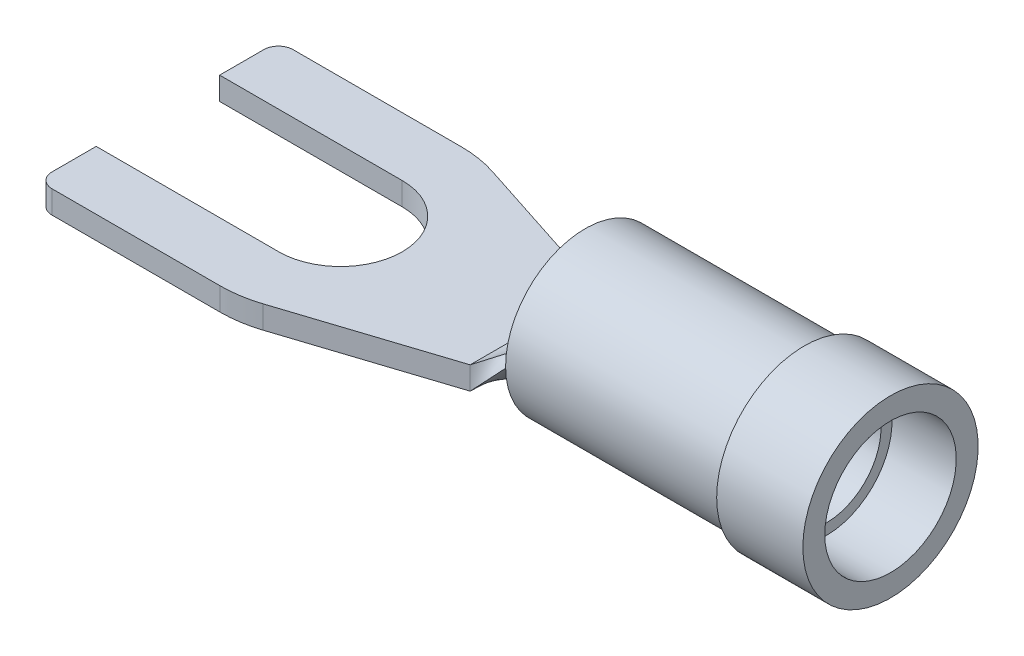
ISO-10303-21;
HEADER;
FILE_DESCRIPTION(('STEP AP214'),'2;1');
FILE_NAME('part.step','',(''),(''),'','','');
FILE_SCHEMA(('AUTOMOTIVE_DESIGN { 1 0 10303 214 1 1 1 1 }'));
ENDSEC;
DATA;
#1=APPLICATION_CONTEXT('core data for automotive mechanical design processes');
#2=APPLICATION_PROTOCOL_DEFINITION('international standard','automotive_design',2000,#1);
#3=PRODUCT_CONTEXT('',#1,'mechanical');
#4=PRODUCT('Part','Part','',(#3));
#5=PRODUCT_RELATED_PRODUCT_CATEGORY('part','',(#4));
#6=PRODUCT_DEFINITION_FORMATION('','',#4);
#7=PRODUCT_DEFINITION_CONTEXT('part definition',#1,'design');
#8=PRODUCT_DEFINITION('design','',#6,#7);
#9=PRODUCT_DEFINITION_SHAPE('','',#8);
#10=(LENGTH_UNIT() NAMED_UNIT(*) SI_UNIT(.MILLI.,.METRE.));
#11=(NAMED_UNIT(*) PLANE_ANGLE_UNIT() SI_UNIT($,.RADIAN.));
#12=(NAMED_UNIT(*) SI_UNIT($,.STERADIAN.) SOLID_ANGLE_UNIT());
#13=UNCERTAINTY_MEASURE_WITH_UNIT(LENGTH_MEASURE(1.E-05),#10,'distance_accuracy_value','');
#14=(GEOMETRIC_REPRESENTATION_CONTEXT(3) GLOBAL_UNCERTAINTY_ASSIGNED_CONTEXT((#13)) GLOBAL_UNIT_ASSIGNED_CONTEXT((#10,
#11,#12)) REPRESENTATION_CONTEXT('',''));
#15=CARTESIAN_POINT('',(0.,0.,0.));
#16=DIRECTION('',(0.,0.,1.));
#17=DIRECTION('',(1.,0.,0.));
#18=AXIS2_PLACEMENT_3D('',#15,#16,#17);
#19=CARTESIAN_POINT('',(8.509,-1.65735,0.));
#20=DIRECTION('',(-1.,0.,0.));
#21=DIRECTION('',(0.,0.,1.));
#22=AXIS2_PLACEMENT_3D('',#19,#20,#21);
#23=PLANE('',#22);
#24=CARTESIAN_POINT('',(8.509,1.11125,0.));
#25=DIRECTION('',(-1.,0.,0.));
#26=DIRECTION('',(0.,0.,1.));
#27=AXIS2_PLACEMENT_3D('',#24,#25,#26);
#28=CIRCLE('',#27,2.7686);
#29=CARTESIAN_POINT('',(8.509,1.11125,2.7686));
#30=VERTEX_POINT('',#29);
#31=EDGE_CURVE('E362',#30,#30,#28,.T.);
#32=ORIENTED_EDGE('',*,*,#31,.T.);
#33=EDGE_LOOP('',(#32));
#34=FACE_BOUND('',#33,.T.);
#35=CARTESIAN_POINT('',(8.509,1.11125,0.));
#36=DIRECTION('',(-1.,0.,0.));
#37=DIRECTION('',(0.,0.,1.));
#38=AXIS2_PLACEMENT_3D('',#35,#36,#37);
#39=CIRCLE('',#38,1.905);
#40=CARTESIAN_POINT('',(8.509,1.11125,1.905));
#41=VERTEX_POINT('',#40);
#42=EDGE_CURVE('E12',#41,#41,#39,.T.);
#43=ORIENTED_EDGE('',*,*,#42,.F.);
#44=EDGE_LOOP('',(#43));
#45=FACE_BOUND('',#44,.T.);
#46=ADVANCED_FACE('F334',(#34,#45),#23,.T.);
#47=CARTESIAN_POINT('',(5.55851083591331,1.11125,0.));
#48=DIRECTION('',(-1.,0.,0.));
#49=DIRECTION('',(0.,0.,1.));
#50=AXIS2_PLACEMENT_3D('',#47,#48,#49);
#51=CYLINDRICAL_SURFACE('',#50,1.905);
#52=ORIENTED_EDGE('',*,*,#42,.T.);
#53=EDGE_LOOP('',(#52));
#54=FACE_BOUND('',#53,.T.);
#55=CARTESIAN_POINT('',(16.891,1.11125,0.));
#56=DIRECTION('',(-1.,0.,0.));
#57=DIRECTION('',(0.,0.,1.));
#58=AXIS2_PLACEMENT_3D('',#55,#56,#57);
#59=CIRCLE('',#58,1.905);
#60=CARTESIAN_POINT('',(16.891,1.11125,1.905));
#61=VERTEX_POINT('',#60);
#62=EDGE_CURVE('E340',#61,#61,#59,.T.);
#63=ORIENTED_EDGE('',*,*,#62,.F.);
#64=EDGE_LOOP('',(#63));
#65=FACE_BOUND('',#64,.T.);
#66=ADVANCED_FACE('F380',(#54,#65),#51,.F.);
#67=CARTESIAN_POINT('',(16.891,-1.17475,0.));
#68=DIRECTION('',(1.,0.,0.));
#69=DIRECTION('',(0.,0.,-1.));
#70=AXIS2_PLACEMENT_3D('',#67,#68,#69);
#71=PLANE('',#70);
#72=ORIENTED_EDGE('',*,*,#62,.T.);
#73=EDGE_LOOP('',(#72));
#74=FACE_BOUND('',#73,.T.);
#75=CARTESIAN_POINT('',(16.891,1.11125,0.));
#76=DIRECTION('',(-1.,0.,0.));
#77=DIRECTION('',(0.,0.,1.));
#78=AXIS2_PLACEMENT_3D('',#75,#76,#77);
#79=CIRCLE('',#78,2.286);
#80=CARTESIAN_POINT('',(16.891,1.11125,2.286));
#81=VERTEX_POINT('',#80);
#82=EDGE_CURVE('E344',#81,#81,#79,.T.);
#83=ORIENTED_EDGE('',*,*,#82,.F.);
#84=EDGE_LOOP('',(#83));
#85=FACE_BOUND('',#84,.T.);
#86=ADVANCED_FACE('F384',(#74,#85),#71,.T.);
#87=CARTESIAN_POINT('',(5.55851083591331,1.11125,0.));
#88=DIRECTION('',(-1.,0.,0.));
#89=DIRECTION('',(0.,0.,1.));
#90=AXIS2_PLACEMENT_3D('',#87,#88,#89);
#91=CYLINDRICAL_SURFACE('',#90,2.286);
#92=ORIENTED_EDGE('',*,*,#82,.T.);
#93=EDGE_LOOP('',(#92));
#94=FACE_BOUND('',#93,.T.);
#95=CARTESIAN_POINT('',(19.1262,1.11125,0.));
#96=DIRECTION('',(-1.,0.,0.));
#97=DIRECTION('',(0.,0.,1.));
#98=AXIS2_PLACEMENT_3D('',#95,#96,#97);
#99=CIRCLE('',#98,2.286);
#100=CARTESIAN_POINT('',(19.1262,1.11125,2.286));
#101=VERTEX_POINT('',#100);
#102=EDGE_CURVE('E348',#101,#101,#99,.T.);
#103=ORIENTED_EDGE('',*,*,#102,.F.);
#104=EDGE_LOOP('',(#103));
#105=FACE_BOUND('',#104,.T.);
#106=ADVANCED_FACE('F388',(#94,#105),#91,.F.);
#107=CARTESIAN_POINT('',(19.1262,-1.93675,0.));
#108=DIRECTION('',(1.,0.,0.));
#109=DIRECTION('',(0.,0.,-1.));
#110=AXIS2_PLACEMENT_3D('',#107,#108,#109);
#111=PLANE('',#110);
#112=ORIENTED_EDGE('',*,*,#102,.T.);
#113=EDGE_LOOP('',(#112));
#114=FACE_BOUND('',#113,.T.);
#115=CARTESIAN_POINT('',(19.1262,1.11125,0.));
#116=DIRECTION('',(-1.,0.,0.));
#117=DIRECTION('',(0.,0.,1.));
#118=AXIS2_PLACEMENT_3D('',#115,#116,#117);
#119=CIRCLE('',#118,3.048);
#120=CARTESIAN_POINT('',(19.1262,1.11125,3.048));
#121=VERTEX_POINT('',#120);
#122=EDGE_CURVE('E353',#121,#121,#119,.T.);
#123=ORIENTED_EDGE('',*,*,#122,.F.);
#124=EDGE_LOOP('',(#123));
#125=FACE_BOUND('',#124,.T.);
#126=ADVANCED_FACE('F394',(#114,#125),#111,.T.);
#127=CARTESIAN_POINT('',(5.55851083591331,1.11125,0.));
#128=DIRECTION('',(-1.,0.,0.));
#129=DIRECTION('',(0.,0.,1.));
#130=AXIS2_PLACEMENT_3D('',#127,#128,#129);
#131=CYLINDRICAL_SURFACE('',#130,3.048);
#132=ORIENTED_EDGE('',*,*,#122,.T.);
#133=EDGE_LOOP('',(#132));
#134=FACE_BOUND('',#133,.T.);
#135=CARTESIAN_POINT('',(16.129,1.11125,0.));
#136=DIRECTION('',(-1.,0.,0.));
#137=DIRECTION('',(0.,0.,1.));
#138=AXIS2_PLACEMENT_3D('',#135,#136,#137);
#139=CIRCLE('',#138,3.048);
#140=CARTESIAN_POINT('',(16.129,1.11125,3.048));
#141=VERTEX_POINT('',#140);
#142=EDGE_CURVE('E356',#141,#141,#139,.T.);
#143=ORIENTED_EDGE('',*,*,#142,.F.);
#144=EDGE_LOOP('',(#143));
#145=FACE_BOUND('',#144,.T.);
#146=ADVANCED_FACE('F376',(#134,#145),#131,.T.);
#147=CARTESIAN_POINT('',(16.129,-1.93675,0.));
#148=DIRECTION('',(-1.,0.,0.));
#149=DIRECTION('',(0.,0.,1.));
#150=AXIS2_PLACEMENT_3D('',#147,#148,#149);
#151=PLANE('',#150);
#152=ORIENTED_EDGE('',*,*,#142,.T.);
#153=EDGE_LOOP('',(#152));
#154=FACE_BOUND('',#153,.T.);
#155=CARTESIAN_POINT('',(16.129,1.11125,0.));
#156=DIRECTION('',(-1.,0.,0.));
#157=DIRECTION('',(0.,0.,1.));
#158=AXIS2_PLACEMENT_3D('',#155,#156,#157);
#159=CIRCLE('',#158,2.7686);
#160=CARTESIAN_POINT('',(16.129,1.11125,2.7686));
#161=VERTEX_POINT('',#160);
#162=EDGE_CURVE('E359',#161,#161,#159,.T.);
#163=ORIENTED_EDGE('',*,*,#162,.F.);
#164=EDGE_LOOP('',(#163));
#165=FACE_BOUND('',#164,.T.);
#166=ADVANCED_FACE('F370',(#154,#165),#151,.T.);
#167=CARTESIAN_POINT('',(5.55851083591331,1.11125,0.));
#168=DIRECTION('',(-1.,0.,0.));
#169=DIRECTION('',(0.,0.,1.));
#170=AXIS2_PLACEMENT_3D('',#167,#168,#169);
#171=CYLINDRICAL_SURFACE('',#170,2.7686);
#172=ORIENTED_EDGE('',*,*,#162,.T.);
#173=EDGE_LOOP('',(#172));
#174=FACE_BOUND('',#173,.T.);
#175=ORIENTED_EDGE('',*,*,#31,.F.);
#176=EDGE_LOOP('',(#175));
#177=FACE_BOUND('',#176,.T.);
#178=ADVANCED_FACE('F368',(#174,#177),#171,.T.);
#179=CLOSED_SHELL('',(#46,#66,#86,#106,#126,#146,#166,#178));
#180=MANIFOLD_SOLID_BREP('B2',#179);
#181=CARTESIAN_POINT('',(-5.842,-0.79375,-3.683));
#182=DIRECTION('',(0.,1.,0.));
#183=DIRECTION('',(0.,0.,1.));
#184=AXIS2_PLACEMENT_3D('',#181,#182,#183);
#185=CYLINDRICAL_SURFACE('',#184,0.508);
#186=CARTESIAN_POINT('',(-5.842,0.,-3.683));
#187=DIRECTION('',(0.,1.,0.));
#188=DIRECTION('',(0.,0.,1.));
#189=AXIS2_PLACEMENT_3D('',#186,#187,#188);
#190=CIRCLE('',#189,0.508);
#191=CARTESIAN_POINT('',(-5.842,0.,-4.191));
#192=VERTEX_POINT('',#191);
#193=CARTESIAN_POINT('',(-6.35,0.,-3.683));
#194=VERTEX_POINT('',#193);
#195=EDGE_CURVE('E598',#192,#194,#190,.T.);
#196=ORIENTED_EDGE('',*,*,#195,.F.);
#197=DIRECTION('',(0.,1.,0.));
#198=VECTOR('',#197,1.);
#199=CARTESIAN_POINT('',(-5.842,-0.79375,-4.191));
#200=LINE('',#199,#198);
#201=CARTESIAN_POINT('',(-5.842,-0.79375,-4.191));
#202=VERTEX_POINT('',#201);
#203=EDGE_CURVE('E332',#202,#192,#200,.T.);
#204=ORIENTED_EDGE('',*,*,#203,.F.);
#205=CARTESIAN_POINT('',(-5.842,-0.79375,-3.683));
#206=DIRECTION('',(0.,1.,0.));
#207=DIRECTION('',(0.,0.,1.));
#208=AXIS2_PLACEMENT_3D('',#205,#206,#207);
#209=CIRCLE('',#208,0.508);
#210=CARTESIAN_POINT('',(-6.35,-0.79375,-3.683));
#211=VERTEX_POINT('',#210);
#212=EDGE_CURVE('E637',#202,#211,#209,.T.);
#213=ORIENTED_EDGE('',*,*,#212,.T.);
#214=DIRECTION('',(0.,1.,0.));
#215=VECTOR('',#214,1.);
#216=CARTESIAN_POINT('',(-6.35,-0.79375,-3.683));
#217=LINE('',#216,#215);
#218=EDGE_CURVE('E532',#211,#194,#217,.T.);
#219=ORIENTED_EDGE('',*,*,#218,.T.);
#220=EDGE_LOOP('',(#196,#204,#213,#219));
#221=FACE_BOUND('',#220,.T.);
#222=ADVANCED_FACE('F455',(#221),#185,.T.);
#223=CARTESIAN_POINT('',(0.,-0.79375,-4.191));
#224=DIRECTION('',(0.,0.,-1.));
#225=DIRECTION('',(-1.,0.,0.));
#226=AXIS2_PLACEMENT_3D('',#223,#224,#225);
#227=PLANE('',#226);
#228=DIRECTION('',(-1.,0.,0.));
#229=VECTOR('',#228,1.);
#230=CARTESIAN_POINT('',(0.,0.,-4.191));
#231=LINE('',#230,#229);
#232=CARTESIAN_POINT('',(0.,0.,-4.191));
#233=VERTEX_POINT('',#232);
#234=EDGE_CURVE('E635',#233,#192,#231,.T.);
#235=ORIENTED_EDGE('',*,*,#234,.F.);
#236=DIRECTION('',(0.,1.,0.));
#237=VECTOR('',#236,1.);
#238=CARTESIAN_POINT('',(0.,-0.79375,-4.191));
#239=LINE('',#238,#237);
#240=CARTESIAN_POINT('',(0.,-0.79375,-4.191));
#241=VERTEX_POINT('',#240);
#242=EDGE_CURVE('E463',#241,#233,#239,.T.);
#243=ORIENTED_EDGE('',*,*,#242,.F.);
#244=DIRECTION('',(-1.,0.,0.));
#245=VECTOR('',#244,1.);
#246=CARTESIAN_POINT('',(0.,-0.79375,-4.191));
#247=LINE('',#246,#245);
#248=EDGE_CURVE('E584',#241,#202,#247,.T.);
#249=ORIENTED_EDGE('',*,*,#248,.T.);
#250=ORIENTED_EDGE('',*,*,#203,.T.);
#251=EDGE_LOOP('',(#235,#243,#249,#250));
#252=FACE_BOUND('',#251,.T.);
#253=ADVANCED_FACE('F817',(#252),#227,.T.);
#254=CARTESIAN_POINT('',(0.,-0.79375,0.));
#255=DIRECTION('',(0.,1.,0.));
#256=DIRECTION('',(0.,0.,1.));
#257=AXIS2_PLACEMENT_3D('',#254,#255,#256);
#258=CYLINDRICAL_SURFACE('',#257,4.191);
#259=CARTESIAN_POINT('',(0.,0.,0.));
#260=DIRECTION('',(0.,1.,0.));
#261=DIRECTION('',(0.,0.,1.));
#262=AXIS2_PLACEMENT_3D('',#259,#260,#261);
#263=CIRCLE('',#262,4.191);
#264=CARTESIAN_POINT('',(1.29319573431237,0.,-3.98649291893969));
#265=VERTEX_POINT('',#264);
#266=EDGE_CURVE('E575',#265,#233,#263,.T.);
#267=ORIENTED_EDGE('',*,*,#266,.F.);
#268=DIRECTION('',(0.,1.,0.));
#269=VECTOR('',#268,1.);
#270=CARTESIAN_POINT('',(1.29319573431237,-0.79375,-3.98649291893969));
#271=LINE('',#270,#269);
#272=CARTESIAN_POINT('',(1.29319573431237,-0.79375,-3.98649291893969));
#273=VERTEX_POINT('',#272);
#274=EDGE_CURVE('E569',#273,#265,#271,.T.);
#275=ORIENTED_EDGE('',*,*,#274,.F.);
#276=CARTESIAN_POINT('',(0.,-0.79375,0.));
#277=DIRECTION('',(0.,1.,0.));
#278=DIRECTION('',(0.,0.,1.));
#279=AXIS2_PLACEMENT_3D('',#276,#277,#278);
#280=CIRCLE('',#279,4.191);
#281=EDGE_CURVE('E572',#273,#241,#280,.T.);
#282=ORIENTED_EDGE('',*,*,#281,.T.);
#283=ORIENTED_EDGE('',*,*,#242,.T.);
#284=EDGE_LOOP('',(#267,#275,#282,#283));
#285=FACE_BOUND('',#284,.T.);
#286=ADVANCED_FACE('F571',(#285),#258,.T.);
#287=CARTESIAN_POINT('',(6.731,-0.79375,-2.2225));
#288=DIRECTION('',(0.308564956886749,0.,-0.951203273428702));
#289=DIRECTION('',(-0.951203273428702,0.,-0.308564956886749));
#290=AXIS2_PLACEMENT_3D('',#287,#288,#289);
#291=PLANE('',#290);
#292=DIRECTION('',(-0.951203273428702,0.,-0.308564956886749));
#293=VECTOR('',#292,1.);
#294=CARTESIAN_POINT('',(6.731,0.,-2.2225));
#295=LINE('',#294,#293);
#296=CARTESIAN_POINT('',(6.731,0.,-2.2225));
#297=VERTEX_POINT('',#296);
#298=EDGE_CURVE('E632',#297,#265,#295,.T.);
#299=ORIENTED_EDGE('',*,*,#298,.F.);
#300=DIRECTION('',(0.,1.,0.));
#301=VECTOR('',#300,1.);
#302=CARTESIAN_POINT('',(6.731,-0.79375,-2.2225));
#303=LINE('',#302,#301);
#304=CARTESIAN_POINT('',(6.731,-0.79375,-2.2225));
#305=VERTEX_POINT('',#304);
#306=EDGE_CURVE('E580',#305,#297,#303,.T.);
#307=ORIENTED_EDGE('',*,*,#306,.F.);
#308=DIRECTION('',(-0.951203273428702,0.,-0.308564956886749));
#309=VECTOR('',#308,1.);
#310=CARTESIAN_POINT('',(6.731,-0.79375,-2.2225));
#311=LINE('',#310,#309);
#312=EDGE_CURVE('E583',#305,#273,#311,.T.);
#313=ORIENTED_EDGE('',*,*,#312,.T.);
#314=ORIENTED_EDGE('',*,*,#274,.T.);
#315=EDGE_LOOP('',(#299,#307,#313,#314));
#316=FACE_BOUND('',#315,.T.);
#317=ADVANCED_FACE('F586',(#316),#291,.T.);
#318=CARTESIAN_POINT('',(6.731,-0.79375,2.2225));
#319=DIRECTION('',(0.308564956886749,0.,0.951203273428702));
#320=DIRECTION('',(0.951203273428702,0.,-0.308564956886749));
#321=AXIS2_PLACEMENT_3D('',#318,#319,#320);
#322=PLANE('',#321);
#323=DIRECTION('',(0.951203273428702,0.,-0.308564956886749));
#324=VECTOR('',#323,1.);
#325=CARTESIAN_POINT('',(6.731,0.,2.2225));
#326=LINE('',#325,#324);
#327=CARTESIAN_POINT('',(1.29319573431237,0.,3.98649291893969));
#328=VERTEX_POINT('',#327);
#329=CARTESIAN_POINT('',(6.731,0.,2.2225));
#330=VERTEX_POINT('',#329);
#331=EDGE_CURVE('E626',#328,#330,#326,.T.);
#332=ORIENTED_EDGE('',*,*,#331,.F.);
#333=DIRECTION('',(0.,1.,0.));
#334=VECTOR('',#333,1.);
#335=CARTESIAN_POINT('',(1.29319573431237,-0.79375,3.98649291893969));
#336=LINE('',#335,#334);
#337=CARTESIAN_POINT('',(1.29319573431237,-0.79375,3.98649291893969));
#338=VERTEX_POINT('',#337);
#339=EDGE_CURVE('E643',#338,#328,#336,.T.);
#340=ORIENTED_EDGE('',*,*,#339,.F.);
#341=DIRECTION('',(0.951203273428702,0.,-0.308564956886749));
#342=VECTOR('',#341,1.);
#343=CARTESIAN_POINT('',(6.731,-0.79375,2.2225));
#344=LINE('',#343,#342);
#345=CARTESIAN_POINT('',(6.731,-0.79375,2.2225));
#346=VERTEX_POINT('',#345);
#347=EDGE_CURVE('E591',#338,#346,#344,.T.);
#348=ORIENTED_EDGE('',*,*,#347,.T.);
#349=DIRECTION('',(0.,1.,0.));
#350=VECTOR('',#349,1.);
#351=CARTESIAN_POINT('',(6.731,-0.79375,2.2225));
#352=LINE('',#351,#350);
#353=EDGE_CURVE('E641',#346,#330,#352,.T.);
#354=ORIENTED_EDGE('',*,*,#353,.T.);
#355=EDGE_LOOP('',(#332,#340,#348,#354));
#356=FACE_BOUND('',#355,.T.);
#357=ADVANCED_FACE('F699',(#356),#322,.T.);
#358=CARTESIAN_POINT('',(0.,-0.79375,0.));
#359=DIRECTION('',(0.,1.,0.));
#360=DIRECTION('',(0.,0.,1.));
#361=AXIS2_PLACEMENT_3D('',#358,#359,#360);
#362=CYLINDRICAL_SURFACE('',#361,4.191);
#363=CARTESIAN_POINT('',(0.,0.,0.));
#364=DIRECTION('',(0.,1.,0.));
#365=DIRECTION('',(0.,0.,1.));
#366=AXIS2_PLACEMENT_3D('',#363,#364,#365);
#367=CIRCLE('',#366,4.191);
#368=CARTESIAN_POINT('',(0.,0.,4.191));
#369=VERTEX_POINT('',#368);
#370=EDGE_CURVE('E623',#369,#328,#367,.T.);
#371=ORIENTED_EDGE('',*,*,#370,.F.);
#372=DIRECTION('',(0.,1.,0.));
#373=VECTOR('',#372,1.);
#374=CARTESIAN_POINT('',(0.,-0.79375,4.191));
#375=LINE('',#374,#373);
#376=CARTESIAN_POINT('',(0.,-0.79375,4.191));
#377=VERTEX_POINT('',#376);
#378=EDGE_CURVE('E645',#377,#369,#375,.T.);
#379=ORIENTED_EDGE('',*,*,#378,.F.);
#380=CARTESIAN_POINT('',(0.,-0.79375,0.));
#381=DIRECTION('',(0.,1.,0.));
#382=DIRECTION('',(0.,0.,1.));
#383=AXIS2_PLACEMENT_3D('',#380,#381,#382);
#384=CIRCLE('',#383,4.191);
#385=EDGE_CURVE('E692',#377,#338,#384,.T.);
#386=ORIENTED_EDGE('',*,*,#385,.T.);
#387=ORIENTED_EDGE('',*,*,#339,.T.);
#388=EDGE_LOOP('',(#371,#379,#386,#387));
#389=FACE_BOUND('',#388,.T.);
#390=ADVANCED_FACE('F849',(#389),#362,.T.);
#391=CARTESIAN_POINT('',(0.,-0.79375,4.191));
#392=DIRECTION('',(0.,0.,1.));
#393=DIRECTION('',(1.,0.,0.));
#394=AXIS2_PLACEMENT_3D('',#391,#392,#393);
#395=PLANE('',#394);
#396=DIRECTION('',(1.,0.,0.));
#397=VECTOR('',#396,1.);
#398=CARTESIAN_POINT('',(0.,0.,4.191));
#399=LINE('',#398,#397);
#400=CARTESIAN_POINT('',(-5.842,0.,4.191));
#401=VERTEX_POINT('',#400);
#402=EDGE_CURVE('E620',#401,#369,#399,.T.);
#403=ORIENTED_EDGE('',*,*,#402,.F.);
#404=DIRECTION('',(0.,1.,0.));
#405=VECTOR('',#404,1.);
#406=CARTESIAN_POINT('',(-5.842,-0.79375,4.191));
#407=LINE('',#406,#405);
#408=CARTESIAN_POINT('',(-5.842,-0.79375,4.191));
#409=VERTEX_POINT('',#408);
#410=EDGE_CURVE('E647',#409,#401,#407,.T.);
#411=ORIENTED_EDGE('',*,*,#410,.F.);
#412=DIRECTION('',(1.,0.,0.));
#413=VECTOR('',#412,1.);
#414=CARTESIAN_POINT('',(0.,-0.79375,4.191));
#415=LINE('',#414,#413);
#416=EDGE_CURVE('E689',#409,#377,#415,.T.);
#417=ORIENTED_EDGE('',*,*,#416,.T.);
#418=ORIENTED_EDGE('',*,*,#378,.T.);
#419=EDGE_LOOP('',(#403,#411,#417,#418));
#420=FACE_BOUND('',#419,.T.);
#421=ADVANCED_FACE('F846',(#420),#395,.T.);
#422=CARTESIAN_POINT('',(-5.842,-0.79375,3.683));
#423=DIRECTION('',(0.,1.,0.));
#424=DIRECTION('',(0.,0.,1.));
#425=AXIS2_PLACEMENT_3D('',#422,#423,#424);
#426=CYLINDRICAL_SURFACE('',#425,0.508);
#427=CARTESIAN_POINT('',(-5.842,0.,3.683));
#428=DIRECTION('',(0.,1.,0.));
#429=DIRECTION('',(0.,0.,-1.));
#430=AXIS2_PLACEMENT_3D('',#427,#428,#429);
#431=CIRCLE('',#430,0.508);
#432=CARTESIAN_POINT('',(-6.35,0.,3.683));
#433=VERTEX_POINT('',#432);
#434=EDGE_CURVE('E617',#433,#401,#431,.T.);
#435=ORIENTED_EDGE('',*,*,#434,.F.);
#436=DIRECTION('',(0.,1.,0.));
#437=VECTOR('',#436,1.);
#438=CARTESIAN_POINT('',(-6.35,-0.79375,3.683));
#439=LINE('',#438,#437);
#440=CARTESIAN_POINT('',(-6.35,-0.79375,3.683));
#441=VERTEX_POINT('',#440);
#442=EDGE_CURVE('E649',#441,#433,#439,.T.);
#443=ORIENTED_EDGE('',*,*,#442,.F.);
#444=CARTESIAN_POINT('',(-5.842,-0.79375,3.683));
#445=DIRECTION('',(0.,1.,0.));
#446=DIRECTION('',(0.,0.,-1.));
#447=AXIS2_PLACEMENT_3D('',#444,#445,#446);
#448=CIRCLE('',#447,0.508);
#449=EDGE_CURVE('E686',#441,#409,#448,.T.);
#450=ORIENTED_EDGE('',*,*,#449,.T.);
#451=ORIENTED_EDGE('',*,*,#410,.T.);
#452=EDGE_LOOP('',(#435,#443,#450,#451));
#453=FACE_BOUND('',#452,.T.);
#454=ADVANCED_FACE('F842',(#453),#426,.T.);
#455=CARTESIAN_POINT('',(-6.35,-0.79375,2.1463));
#456=DIRECTION('',(-1.,0.,0.));
#457=DIRECTION('',(0.,0.,1.));
#458=AXIS2_PLACEMENT_3D('',#455,#456,#457);
#459=PLANE('',#458);
#460=DIRECTION('',(0.,0.,1.));
#461=VECTOR('',#460,1.);
#462=CARTESIAN_POINT('',(-6.35,0.,2.1463));
#463=LINE('',#462,#461);
#464=CARTESIAN_POINT('',(-6.35,0.,2.1463));
#465=VERTEX_POINT('',#464);
#466=EDGE_CURVE('E614',#465,#433,#463,.T.);
#467=ORIENTED_EDGE('',*,*,#466,.F.);
#468=DIRECTION('',(0.,1.,0.));
#469=VECTOR('',#468,1.);
#470=CARTESIAN_POINT('',(-6.35,-0.79375,2.1463));
#471=LINE('',#470,#469);
#472=CARTESIAN_POINT('',(-6.35,-0.79375,2.1463));
#473=VERTEX_POINT('',#472);
#474=EDGE_CURVE('E651',#473,#465,#471,.T.);
#475=ORIENTED_EDGE('',*,*,#474,.F.);
#476=DIRECTION('',(0.,0.,1.));
#477=VECTOR('',#476,1.);
#478=CARTESIAN_POINT('',(-6.35,-0.79375,2.1463));
#479=LINE('',#478,#477);
#480=EDGE_CURVE('E683',#473,#441,#479,.T.);
#481=ORIENTED_EDGE('',*,*,#480,.T.);
#482=ORIENTED_EDGE('',*,*,#442,.T.);
#483=EDGE_LOOP('',(#467,#475,#481,#482));
#484=FACE_BOUND('',#483,.T.);
#485=ADVANCED_FACE('F838',(#484),#459,.T.);
#486=CARTESIAN_POINT('',(0.,-0.79375,2.1463));
#487=DIRECTION('',(0.,0.,-1.));
#488=DIRECTION('',(-1.,0.,0.));
#489=AXIS2_PLACEMENT_3D('',#486,#487,#488);
#490=PLANE('',#489);
#491=DIRECTION('',(-1.,0.,0.));
#492=VECTOR('',#491,1.);
#493=CARTESIAN_POINT('',(0.,0.,2.1463));
#494=LINE('',#493,#492);
#495=CARTESIAN_POINT('',(0.,0.,2.1463));
#496=VERTEX_POINT('',#495);
#497=EDGE_CURVE('E611',#496,#465,#494,.T.);
#498=ORIENTED_EDGE('',*,*,#497,.F.);
#499=DIRECTION('',(0.,1.,0.));
#500=VECTOR('',#499,1.);
#501=CARTESIAN_POINT('',(0.,-0.79375,2.1463));
#502=LINE('',#501,#500);
#503=CARTESIAN_POINT('',(0.,-0.79375,2.1463));
#504=VERTEX_POINT('',#503);
#505=EDGE_CURVE('E653',#504,#496,#502,.T.);
#506=ORIENTED_EDGE('',*,*,#505,.F.);
#507=DIRECTION('',(-1.,0.,0.));
#508=VECTOR('',#507,1.);
#509=CARTESIAN_POINT('',(0.,-0.79375,2.1463));
#510=LINE('',#509,#508);
#511=EDGE_CURVE('E680',#504,#473,#510,.T.);
#512=ORIENTED_EDGE('',*,*,#511,.T.);
#513=ORIENTED_EDGE('',*,*,#474,.T.);
#514=EDGE_LOOP('',(#498,#506,#512,#513));
#515=FACE_BOUND('',#514,.T.);
#516=ADVANCED_FACE('F834',(#515),#490,.T.);
#517=CARTESIAN_POINT('',(0.,-0.79375,0.));
#518=DIRECTION('',(0.,1.,0.));
#519=DIRECTION('',(0.,0.,1.));
#520=AXIS2_PLACEMENT_3D('',#517,#518,#519);
#521=CYLINDRICAL_SURFACE('',#520,2.1463);
#522=CARTESIAN_POINT('',(0.,0.,0.));
#523=DIRECTION('',(0.,-1.,0.));
#524=DIRECTION('',(0.,0.,1.));
#525=AXIS2_PLACEMENT_3D('',#522,#523,#524);
#526=CIRCLE('',#525,2.1463);
#527=CARTESIAN_POINT('',(0.,0.,-2.1463));
#528=VERTEX_POINT('',#527);
#529=EDGE_CURVE('E608',#528,#496,#526,.T.);
#530=ORIENTED_EDGE('',*,*,#529,.F.);
#531=DIRECTION('',(0.,1.,0.));
#532=VECTOR('',#531,1.);
#533=CARTESIAN_POINT('',(0.,-0.79375,-2.1463));
#534=LINE('',#533,#532);
#535=CARTESIAN_POINT('',(0.,-0.79375,-2.1463));
#536=VERTEX_POINT('',#535);
#537=EDGE_CURVE('E655',#536,#528,#534,.T.);
#538=ORIENTED_EDGE('',*,*,#537,.F.);
#539=CARTESIAN_POINT('',(0.,-0.79375,0.));
#540=DIRECTION('',(0.,-1.,0.));
#541=DIRECTION('',(0.,0.,1.));
#542=AXIS2_PLACEMENT_3D('',#539,#540,#541);
#543=CIRCLE('',#542,2.1463);
#544=EDGE_CURVE('E677',#536,#504,#543,.T.);
#545=ORIENTED_EDGE('',*,*,#544,.T.);
#546=ORIENTED_EDGE('',*,*,#505,.T.);
#547=EDGE_LOOP('',(#530,#538,#545,#546));
#548=FACE_BOUND('',#547,.T.);
#549=ADVANCED_FACE('F830',(#548),#521,.F.);
#550=CARTESIAN_POINT('',(0.,-0.79375,-2.1463));
#551=DIRECTION('',(0.,0.,1.));
#552=DIRECTION('',(1.,0.,0.));
#553=AXIS2_PLACEMENT_3D('',#550,#551,#552);
#554=PLANE('',#553);
#555=DIRECTION('',(1.,0.,0.));
#556=VECTOR('',#555,1.);
#557=CARTESIAN_POINT('',(0.,0.,-2.1463));
#558=LINE('',#557,#556);
#559=CARTESIAN_POINT('',(-6.35,0.,-2.1463));
#560=VERTEX_POINT('',#559);
#561=EDGE_CURVE('E605',#560,#528,#558,.T.);
#562=ORIENTED_EDGE('',*,*,#561,.F.);
#563=DIRECTION('',(0.,1.,0.));
#564=VECTOR('',#563,1.);
#565=CARTESIAN_POINT('',(-6.35,-0.79375,-2.1463));
#566=LINE('',#565,#564);
#567=CARTESIAN_POINT('',(-6.35,-0.79375,-2.1463));
#568=VERTEX_POINT('',#567);
#569=EDGE_CURVE('E657',#568,#560,#566,.T.);
#570=ORIENTED_EDGE('',*,*,#569,.F.);
#571=DIRECTION('',(1.,0.,0.));
#572=VECTOR('',#571,1.);
#573=CARTESIAN_POINT('',(0.,-0.79375,-2.1463));
#574=LINE('',#573,#572);
#575=EDGE_CURVE('E674',#568,#536,#574,.T.);
#576=ORIENTED_EDGE('',*,*,#575,.T.);
#577=ORIENTED_EDGE('',*,*,#537,.T.);
#578=EDGE_LOOP('',(#562,#570,#576,#577));
#579=FACE_BOUND('',#578,.T.);
#580=ADVANCED_FACE('F826',(#579),#554,.T.);
#581=CARTESIAN_POINT('',(-6.35,-0.79375,-3.683));
#582=DIRECTION('',(-1.,0.,0.));
#583=DIRECTION('',(0.,0.,1.));
#584=AXIS2_PLACEMENT_3D('',#581,#582,#583);
#585=PLANE('',#584);
#586=DIRECTION('',(0.,0.,1.));
#587=VECTOR('',#586,1.);
#588=CARTESIAN_POINT('',(-6.35,0.,-3.683));
#589=LINE('',#588,#587);
#590=EDGE_CURVE('E601',#194,#560,#589,.T.);
#591=ORIENTED_EDGE('',*,*,#590,.F.);
#592=ORIENTED_EDGE('',*,*,#218,.F.);
#593=DIRECTION('',(0.,0.,1.));
#594=VECTOR('',#593,1.);
#595=CARTESIAN_POINT('',(-6.35,-0.79375,-3.683));
#596=LINE('',#595,#594);
#597=EDGE_CURVE('E672',#211,#568,#596,.T.);
#598=ORIENTED_EDGE('',*,*,#597,.T.);
#599=ORIENTED_EDGE('',*,*,#569,.T.);
#600=EDGE_LOOP('',(#591,#592,#598,#599));
#601=FACE_BOUND('',#600,.T.);
#602=ADVANCED_FACE('F823',(#601),#585,.T.);
#603=CARTESIAN_POINT('',(-5.842,-0.79375,-3.683));
#604=DIRECTION('',(0.,1.,0.));
#605=DIRECTION('',(0.,0.,1.));
#606=AXIS2_PLACEMENT_3D('',#603,#604,#605);
#607=PLANE('',#606);
#608=ORIENTED_EDGE('',*,*,#212,.F.);
#609=ORIENTED_EDGE('',*,*,#248,.F.);
#610=ORIENTED_EDGE('',*,*,#281,.F.);
#611=ORIENTED_EDGE('',*,*,#312,.F.);
#612=DIRECTION('',(0.,0.,-1.));
#613=VECTOR('',#612,1.);
#614=CARTESIAN_POINT('',(6.731,-0.79375,2.2225));
#615=LINE('',#614,#613);
#616=CARTESIAN_POINT('',(6.731,-0.79375,0.));
#617=VERTEX_POINT('',#616);
#618=EDGE_CURVE('E471',#617,#305,#615,.T.);
#619=ORIENTED_EDGE('',*,*,#618,.F.);
#620=DIRECTION('',(0.,0.,-1.));
#621=VECTOR('',#620,1.);
#622=CARTESIAN_POINT('',(6.731,-0.79375,-2.2225));
#623=LINE('',#622,#621);
#624=EDGE_CURVE('E588',#346,#617,#623,.T.);
#625=ORIENTED_EDGE('',*,*,#624,.F.);
#626=ORIENTED_EDGE('',*,*,#347,.F.);
#627=ORIENTED_EDGE('',*,*,#385,.F.);
#628=ORIENTED_EDGE('',*,*,#416,.F.);
#629=ORIENTED_EDGE('',*,*,#449,.F.);
#630=ORIENTED_EDGE('',*,*,#480,.F.);
#631=ORIENTED_EDGE('',*,*,#511,.F.);
#632=ORIENTED_EDGE('',*,*,#544,.F.);
#633=ORIENTED_EDGE('',*,*,#575,.F.);
#634=ORIENTED_EDGE('',*,*,#597,.F.);
#635=EDGE_LOOP('',(#608,#609,#610,#611,#619,#625,#626,#627,#628,#629,#630,#631,#632,#633,#634));
#636=FACE_BOUND('',#635,.T.);
#637=ADVANCED_FACE('F582',(#636),#607,.F.);
#638=CARTESIAN_POINT('',(-5.842,0.,-3.683));
#639=DIRECTION('',(0.,1.,0.));
#640=DIRECTION('',(0.,0.,1.));
#641=AXIS2_PLACEMENT_3D('',#638,#639,#640);
#642=PLANE('',#641);
#643=ORIENTED_EDGE('',*,*,#195,.T.);
#644=ORIENTED_EDGE('',*,*,#590,.T.);
#645=ORIENTED_EDGE('',*,*,#561,.T.);
#646=ORIENTED_EDGE('',*,*,#529,.T.);
#647=ORIENTED_EDGE('',*,*,#497,.T.);
#648=ORIENTED_EDGE('',*,*,#466,.T.);
#649=ORIENTED_EDGE('',*,*,#434,.T.);
#650=ORIENTED_EDGE('',*,*,#402,.T.);
#651=ORIENTED_EDGE('',*,*,#370,.T.);
#652=ORIENTED_EDGE('',*,*,#331,.T.);
#653=DIRECTION('',(0.,0.,-1.));
#654=VECTOR('',#653,1.);
#655=CARTESIAN_POINT('',(6.731,0.,-2.2225));
#656=LINE('',#655,#654);
#657=EDGE_CURVE('E629',#330,#297,#656,.T.);
#658=ORIENTED_EDGE('',*,*,#657,.T.);
#659=ORIENTED_EDGE('',*,*,#298,.T.);
#660=ORIENTED_EDGE('',*,*,#266,.T.);
#661=ORIENTED_EDGE('',*,*,#234,.T.);
#662=EDGE_LOOP('',(#643,#644,#645,#646,#647,#648,#649,#650,#651,#652,#658,#659,#660,#661));
#663=FACE_BOUND('',#662,.T.);
#664=ADVANCED_FACE('F760',(#663),#642,.T.);
#665=CARTESIAN_POINT('',(8.509,1.11125,1.905));
#666=CARTESIAN_POINT('',(6.731,-0.79375,2.2225));
#667=CARTESIAN_POINT('',(8.509,1.11125,1.11125));
#668=CARTESIAN_POINT('',(6.731,0.,2.2225));
#669=B_SPLINE_SURFACE_WITH_KNOTS('',1,1,((#665,#666),(#667,#668)),.UNSPECIFIED.,.F.,.F.,.F.,(2,
2),(2,2),(0.,1.),(0.,1.),.UNSPECIFIED.);
#670=DIRECTION('',(0.,0.,-1.));
#671=VECTOR('',#670,1.);
#672=CARTESIAN_POINT('',(8.509,1.11125,1.11125));
#673=LINE('',#672,#671);
#674=CARTESIAN_POINT('',(8.509,1.11125,1.905));
#675=VERTEX_POINT('',#674);
#676=CARTESIAN_POINT('',(8.509,1.11125,1.11125));
#677=VERTEX_POINT('',#676);
#678=EDGE_CURVE('E726',#675,#677,#673,.T.);
#679=DIRECTION('',(-0.749268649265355,-0.468292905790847,0.468292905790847));
#680=VECTOR('',#679,1.);
#681=CARTESIAN_POINT('',(7.62,0.555625,1.666875));
#682=LINE('',#681,#680);
#683=EDGE_CURVE('E710',#677,#330,#682,.T.);
#684=DIRECTION('',(0.677309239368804,0.72568847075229,-0.120948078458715));
#685=VECTOR('',#684,1.);
#686=CARTESIAN_POINT('',(7.62,0.15875,2.06375));
#687=LINE('',#686,#685);
#688=EDGE_CURVE('E708',#346,#675,#687,.T.);
#689=ORIENTED_EDGE('',*,*,#678,.T.);
#690=ORIENTED_EDGE('',*,*,#683,.T.);
#691=ORIENTED_EDGE('',*,*,#353,.F.);
#692=ORIENTED_EDGE('',*,*,#688,.T.);
#693=EDGE_LOOP('',(#689,#690,#691,#692));
#694=FACE_BOUND('',#693,.T.);
#695=ADVANCED_FACE('F706',(#694),#669,.T.);
#696=CARTESIAN_POINT('',(8.509,1.11125,1.11125));
#697=CARTESIAN_POINT('',(6.731,0.,2.2225));
#698=CARTESIAN_POINT('',(8.509,-1.11125,1.11125));
#699=CARTESIAN_POINT('',(6.731,0.,0.740833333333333));
#700=CARTESIAN_POINT('',(8.509,-1.11125,-1.11125));
#701=CARTESIAN_POINT('',(6.731,0.,-0.740833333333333));
#702=CARTESIAN_POINT('',(8.509,1.11125,-1.11125));
#703=CARTESIAN_POINT('',(6.731,0.,-2.2225));
#704=(BOUNDED_SURFACE() B_SPLINE_SURFACE(3,1,((#696,#697),(#698,#699),(#700,#701),(#702,#703)),
.UNSPECIFIED.,.F.,.F.,.F.) B_SPLINE_SURFACE_WITH_KNOTS((4,4),(2,2),(0.,1.),(0.,1.),
.UNSPECIFIED.) GEOMETRIC_REPRESENTATION_ITEM() RATIONAL_B_SPLINE_SURFACE(((1.,1.),
(0.333333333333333,1.),(0.333333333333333,1.),(1.,1.))) REPRESENTATION_ITEM('') SURFACE());
#705=CARTESIAN_POINT('',(8.509,1.11125,0.));
#706=DIRECTION('',(1.,0.,0.));
#707=DIRECTION('',(0.,0.,1.));
#708=AXIS2_PLACEMENT_3D('',#705,#706,#707);
#709=CIRCLE('',#708,1.11125);
#710=CARTESIAN_POINT('',(8.509,1.11125,-1.11125));
#711=VERTEX_POINT('',#710);
#712=EDGE_CURVE('E718',#677,#711,#709,.T.);
#713=DIRECTION('',(-0.749268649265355,-0.468292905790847,-0.468292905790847));
#714=VECTOR('',#713,1.);
#715=CARTESIAN_POINT('',(7.62,0.555625,-1.666875));
#716=LINE('',#715,#714);
#717=EDGE_CURVE('E717',#711,#297,#716,.T.);
#718=ORIENTED_EDGE('',*,*,#712,.T.);
#719=ORIENTED_EDGE('',*,*,#717,.T.);
#720=ORIENTED_EDGE('',*,*,#657,.F.);
#721=ORIENTED_EDGE('',*,*,#683,.F.);
#722=EDGE_LOOP('',(#718,#719,#720,#721));
#723=FACE_BOUND('',#722,.T.);
#724=ADVANCED_FACE('F756',(#723),#704,.T.);
#725=CARTESIAN_POINT('',(8.509,-0.79375,0.));
#726=CARTESIAN_POINT('',(8.41022222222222,-0.79375,0.));
#727=CARTESIAN_POINT('',(8.21266666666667,-0.79375,0.));
#728=CARTESIAN_POINT('',(7.81755555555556,-0.79375,0.));
#729=CARTESIAN_POINT('',(7.42244444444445,-0.79375,0.));
#730=CARTESIAN_POINT('',(7.02733333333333,-0.79375,0.));
#731=CARTESIAN_POINT('',(6.82977777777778,-0.79375,0.));
#732=CARTESIAN_POINT('',(6.731,-0.79375,0.));
#733=CARTESIAN_POINT('',(8.509,-0.79375,1.11592316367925));
#734=CARTESIAN_POINT('',(8.40991296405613,-0.79375,1.09070453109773));
#735=CARTESIAN_POINT('',(8.21878079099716,-0.79375,1.04205949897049));
#736=CARTESIAN_POINT('',(7.82737310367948,-0.793750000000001,0.956413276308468));
#737=CARTESIAN_POINT('',(7.43198276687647,-0.79375,0.873774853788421));
#738=CARTESIAN_POINT('',(7.03247335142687,-0.79375,0.794056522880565));
#739=CARTESIAN_POINT('',(6.82952890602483,-0.79375,0.758227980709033));
#740=CARTESIAN_POINT('',(6.731,-0.79375,0.740833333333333));
#741=CARTESIAN_POINT('',(8.509,-0.00467316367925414,1.905));
#742=CARTESIAN_POINT('',(8.38529601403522,-0.0595730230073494,1.87554667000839));
#743=CARTESIAN_POINT('',(8.14667941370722,-0.16547112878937,1.81873319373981));
#744=CARTESIAN_POINT('',(7.73066209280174,-0.350099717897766,1.71968145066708));
#745=CARTESIAN_POINT('',(7.33802236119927,-0.524353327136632,1.62619580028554));
#746=CARTESIAN_POINT('',(6.9718592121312,-0.686856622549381,1.53901409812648));
#747=CARTESIAN_POINT('',(6.80971871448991,-0.758814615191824,1.50040921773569));
#748=CARTESIAN_POINT('',(6.731,-0.79375,1.48166666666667));
#749=CARTESIAN_POINT('',(8.509,1.11125,1.905));
#750=CARTESIAN_POINT('',(8.41022222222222,1.00541666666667,1.92263888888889));
#751=CARTESIAN_POINT('',(8.21266666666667,0.79375,1.95791666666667));
#752=CARTESIAN_POINT('',(7.81755555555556,0.370416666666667,2.02847222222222));
#753=CARTESIAN_POINT('',(7.42244444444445,-0.0529166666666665,2.09902777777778));
#754=CARTESIAN_POINT('',(7.02733333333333,-0.47625,2.16958333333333));
#755=CARTESIAN_POINT('',(6.82977777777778,-0.687916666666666,2.20486111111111));
#756=CARTESIAN_POINT('',(6.731,-0.79375,2.2225));
#757=(BOUNDED_SURFACE() B_SPLINE_SURFACE(3,3,((#725,#726,#727,#728,#729,#730,#731,#732),(#733,
#734,#735,#736,#737,#738,#739,#740),(#741,#742,#743,#744,#745,#746,#747,#748),(#749,#750,#751,
#752,#753,#754,#755,#756)),.UNSPECIFIED.,.F.,.F.,.F.) B_SPLINE_SURFACE_WITH_KNOTS((4,4),(4,1,1,
1,1,4),(0.5,1.),(0.,0.166666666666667,0.333333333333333,0.666666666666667,0.833333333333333,1.),
.UNSPECIFIED.) GEOMETRIC_REPRESENTATION_ITEM() RATIONAL_B_SPLINE_SURFACE(((1.,1.,1.,1.,1.,1.,1.,
1.),(0.804737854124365,0.804737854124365,0.824264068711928,0.889351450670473,0.915386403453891,
0.980473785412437,1.,1.),(0.804737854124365,0.804737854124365,0.824264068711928,
0.889351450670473,0.915386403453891,0.980473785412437,1.,1.),(1.,1.,1.,1.,1.,1.,1.,1.))) REPRESENTATION_ITEM('') SURFACE());
#758=CARTESIAN_POINT('',(8.509,1.11125,0.));
#759=DIRECTION('',(-1.,0.,0.));
#760=DIRECTION('',(0.,0.,1.));
#761=AXIS2_PLACEMENT_3D('',#758,#759,#760);
#762=CIRCLE('',#761,1.905);
#763=CARTESIAN_POINT('',(8.509,-0.79375,0.));
#764=VERTEX_POINT('',#763);
#765=EDGE_CURVE('E716',#764,#675,#762,.T.);
#766=DIRECTION('',(-1.,0.,0.));
#767=VECTOR('',#766,1.);
#768=CARTESIAN_POINT('',(7.62,-0.79375,0.));
#769=LINE('',#768,#767);
#770=EDGE_CURVE('E664',#764,#617,#769,.T.);
#771=ORIENTED_EDGE('',*,*,#765,.T.);
#772=ORIENTED_EDGE('',*,*,#688,.F.);
#773=ORIENTED_EDGE('',*,*,#624,.T.);
#774=ORIENTED_EDGE('',*,*,#770,.F.);
#775=EDGE_LOOP('',(#771,#772,#773,#774));
#776=FACE_BOUND('',#775,.T.);
#777=ADVANCED_FACE('F713',(#776),#757,.T.);
#778=CARTESIAN_POINT('',(8.509,1.11125,-1.905));
#779=CARTESIAN_POINT('',(8.41022222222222,1.00541666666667,-1.92263888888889));
#780=CARTESIAN_POINT('',(8.21266666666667,0.79375,-1.95791666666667));
#781=CARTESIAN_POINT('',(7.81755555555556,0.370416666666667,-2.02847222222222));
#782=CARTESIAN_POINT('',(7.42244444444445,-0.0529166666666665,-2.09902777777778));
#783=CARTESIAN_POINT('',(7.02733333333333,-0.47625,-2.16958333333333));
#784=CARTESIAN_POINT('',(6.82977777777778,-0.687916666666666,-2.20486111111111));
#785=CARTESIAN_POINT('',(6.731,-0.79375,-2.2225));
#786=CARTESIAN_POINT('',(8.509,-0.00467316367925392,-1.905));
#787=CARTESIAN_POINT('',(8.38529601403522,-0.0595730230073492,-1.87554667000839));
#788=CARTESIAN_POINT('',(8.14667941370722,-0.16547112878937,-1.81873319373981));
#789=CARTESIAN_POINT('',(7.73066209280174,-0.350099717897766,-1.71968145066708));
#790=CARTESIAN_POINT('',(7.33802236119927,-0.524353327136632,-1.62619580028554));
#791=CARTESIAN_POINT('',(6.9718592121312,-0.686856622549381,-1.53901409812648));
#792=CARTESIAN_POINT('',(6.80971871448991,-0.758814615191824,-1.50040921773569));
#793=CARTESIAN_POINT('',(6.731,-0.79375,-1.48166666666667));
#794=CARTESIAN_POINT('',(8.509,-0.79375,-1.11592316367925));
#795=CARTESIAN_POINT('',(8.40991296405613,-0.79375,-1.09070453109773));
#796=CARTESIAN_POINT('',(8.21878079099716,-0.79375,-1.04205949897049));
#797=CARTESIAN_POINT('',(7.82737310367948,-0.79375,-0.956413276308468));
#798=CARTESIAN_POINT('',(7.43198276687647,-0.79375,-0.873774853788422));
#799=CARTESIAN_POINT('',(7.03247335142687,-0.79375,-0.794056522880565));
#800=CARTESIAN_POINT('',(6.82952890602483,-0.79375,-0.758227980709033));
#801=CARTESIAN_POINT('',(6.731,-0.79375,-0.740833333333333));
#802=CARTESIAN_POINT('',(8.509,-0.79375,0.));
#803=CARTESIAN_POINT('',(8.41022222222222,-0.79375,0.));
#804=CARTESIAN_POINT('',(8.21266666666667,-0.79375,0.));
#805=CARTESIAN_POINT('',(7.81755555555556,-0.79375,0.));
#806=CARTESIAN_POINT('',(7.42244444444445,-0.79375,0.));
#807=CARTESIAN_POINT('',(7.02733333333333,-0.79375,0.));
#808=CARTESIAN_POINT('',(6.82977777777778,-0.79375,0.));
#809=CARTESIAN_POINT('',(6.731,-0.79375,0.));
#810=(BOUNDED_SURFACE() B_SPLINE_SURFACE(3,3,((#778,#779,#780,#781,#782,#783,#784,#785),(#786,
#787,#788,#789,#790,#791,#792,#793),(#794,#795,#796,#797,#798,#799,#800,#801),(#802,#803,#804,
#805,#806,#807,#808,#809)),.UNSPECIFIED.,.F.,.F.,.F.) B_SPLINE_SURFACE_WITH_KNOTS((4,4),(4,1,1,
1,1,4),(0.,0.5),(0.,0.166666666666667,0.333333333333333,0.666666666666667,0.833333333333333,1.),
.UNSPECIFIED.) GEOMETRIC_REPRESENTATION_ITEM() RATIONAL_B_SPLINE_SURFACE(((1.,1.,1.,1.,1.,1.,1.,
1.),(0.804737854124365,0.804737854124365,0.824264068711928,0.889351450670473,0.915386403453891,
0.980473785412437,1.,1.),(0.804737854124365,0.804737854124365,0.824264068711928,
0.889351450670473,0.915386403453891,0.980473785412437,1.,1.),(1.,1.,1.,1.,1.,1.,1.,1.))) REPRESENTATION_ITEM('') SURFACE());
#811=CARTESIAN_POINT('',(8.509,1.11125,-1.905));
#812=VERTEX_POINT('',#811);
#813=EDGE_CURVE('E725',#812,#764,#762,.T.);
#814=DIRECTION('',(-0.677309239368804,-0.72568847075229,-0.120948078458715));
#815=VECTOR('',#814,1.);
#816=CARTESIAN_POINT('',(7.62,0.15875,-2.06375));
#817=LINE('',#816,#815);
#818=EDGE_CURVE('E662',#812,#305,#817,.T.);
#819=ORIENTED_EDGE('',*,*,#813,.T.);
#820=ORIENTED_EDGE('',*,*,#770,.T.);
#821=ORIENTED_EDGE('',*,*,#618,.T.);
#822=ORIENTED_EDGE('',*,*,#818,.F.);
#823=EDGE_LOOP('',(#819,#820,#821,#822));
#824=FACE_BOUND('',#823,.T.);
#825=ADVANCED_FACE('F771',(#824),#810,.T.);
#826=CARTESIAN_POINT('',(8.509,1.11125,-1.11125));
#827=CARTESIAN_POINT('',(6.731,0.,-2.2225));
#828=CARTESIAN_POINT('',(8.509,1.11125,-1.905));
#829=CARTESIAN_POINT('',(6.731,-0.79375,-2.2225));
#830=B_SPLINE_SURFACE_WITH_KNOTS('',1,1,((#826,#827),(#828,#829)),.UNSPECIFIED.,.F.,.F.,.F.,(2,
2),(2,2),(0.,1.),(0.,1.),.UNSPECIFIED.);
#831=DIRECTION('',(0.,0.,-1.));
#832=VECTOR('',#831,1.);
#833=CARTESIAN_POINT('',(8.509,1.11125,-1.11125));
#834=LINE('',#833,#832);
#835=EDGE_CURVE('E602',#711,#812,#834,.T.);
#836=ORIENTED_EDGE('',*,*,#835,.T.);
#837=ORIENTED_EDGE('',*,*,#818,.T.);
#838=ORIENTED_EDGE('',*,*,#306,.T.);
#839=ORIENTED_EDGE('',*,*,#717,.F.);
#840=EDGE_LOOP('',(#836,#837,#838,#839));
#841=FACE_BOUND('',#840,.T.);
#842=ADVANCED_FACE('F764',(#841),#830,.T.);
#843=CARTESIAN_POINT('',(8.509,2.22144233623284,-0.0484720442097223));
#844=DIRECTION('',(-1.,0.,0.));
#845=DIRECTION('',(0.,0.,1.));
#846=AXIS2_PLACEMENT_3D('',#843,#844,#845);
#847=PLANE('',#846);
#848=ORIENTED_EDGE('',*,*,#678,.F.);
#849=CARTESIAN_POINT('',(8.509,1.11125,0.));
#850=DIRECTION('',(-1.,0.,0.));
#851=DIRECTION('',(0.,0.,1.));
#852=AXIS2_PLACEMENT_3D('',#849,#850,#851);
#853=CIRCLE('',#852,1.905);
#854=CARTESIAN_POINT('',(8.509,3.01443686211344,0.0830949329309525));
#855=VERTEX_POINT('',#854);
#856=EDGE_CURVE('E794',#675,#855,#853,.T.);
#857=ORIENTED_EDGE('',*,*,#856,.T.);
#858=DIRECTION('',(0.,0.999048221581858,0.0436193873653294));
#859=VECTOR('',#858,1.);
#860=CARTESIAN_POINT('',(8.509,2.22144233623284,0.0484720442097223));
#861=LINE('',#860,#859);
#862=CARTESIAN_POINT('',(8.509,2.22144233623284,0.0484720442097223));
#863=VERTEX_POINT('',#862);
#864=EDGE_CURVE('E1003',#863,#855,#861,.T.);
#865=ORIENTED_EDGE('',*,*,#864,.F.);
#866=CARTESIAN_POINT('',(8.509,1.11125,0.));
#867=DIRECTION('',(-1.,0.,0.));
#868=DIRECTION('',(0.,0.,1.));
#869=AXIS2_PLACEMENT_3D('',#866,#867,#868);
#870=CIRCLE('',#869,1.11125);
#871=EDGE_CURVE('E730',#677,#863,#870,.T.);
#872=ORIENTED_EDGE('',*,*,#871,.F.);
#873=EDGE_LOOP('',(#848,#857,#865,#872));
#874=FACE_BOUND('',#873,.T.);
#875=ADVANCED_FACE('F813',(#874),#847,.T.);
#876=ORIENTED_EDGE('',*,*,#835,.F.);
#877=CARTESIAN_POINT('',(8.509,2.22144233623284,-0.0484720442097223));
#878=VERTEX_POINT('',#877);
#879=EDGE_CURVE('E1030',#878,#711,#870,.T.);
#880=ORIENTED_EDGE('',*,*,#879,.F.);
#881=DIRECTION('',(0.,0.999048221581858,-0.0436193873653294));
#882=VECTOR('',#881,1.);
#883=CARTESIAN_POINT('',(8.509,2.22144233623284,-0.0484720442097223));
#884=LINE('',#883,#882);
#885=CARTESIAN_POINT('',(8.509,3.01443686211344,-0.0830949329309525));
#886=VERTEX_POINT('',#885);
#887=EDGE_CURVE('E791',#878,#886,#884,.T.);
#888=ORIENTED_EDGE('',*,*,#887,.T.);
#889=EDGE_CURVE('E663',#886,#812,#853,.T.);
#890=ORIENTED_EDGE('',*,*,#889,.T.);
#891=EDGE_LOOP('',(#876,#880,#888,#890));
#892=FACE_BOUND('',#891,.T.);
#893=ADVANCED_FACE('F787',(#892),#847,.T.);
#894=CARTESIAN_POINT('',(6.5460439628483,1.11125,0.));
#895=DIRECTION('',(-1.,0.,0.));
#896=DIRECTION('',(0.,0.,1.));
#897=AXIS2_PLACEMENT_3D('',#894,#895,#896);
#898=CYLINDRICAL_SURFACE('',#897,1.905);
#899=CARTESIAN_POINT('',(12.827,1.11125,0.));
#900=DIRECTION('',(-1.,0.,0.));
#901=DIRECTION('',(0.,0.,1.));
#902=AXIS2_PLACEMENT_3D('',#899,#900,#901);
#903=CIRCLE('',#902,1.905);
#904=CARTESIAN_POINT('',(12.827,3.01443686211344,-0.0830949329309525));
#905=VERTEX_POINT('',#904);
#906=CARTESIAN_POINT('',(12.827,3.01443686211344,0.0830949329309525));
#907=VERTEX_POINT('',#906);
#908=EDGE_CURVE('E801',#905,#907,#903,.T.);
#909=ORIENTED_EDGE('',*,*,#908,.T.);
#910=DIRECTION('',(1.,0.,0.));
#911=VECTOR('',#910,1.);
#912=CARTESIAN_POINT('',(8.509,3.01443686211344,0.0830949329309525));
#913=LINE('',#912,#911);
#914=EDGE_CURVE('E1005',#855,#907,#913,.T.);
#915=ORIENTED_EDGE('',*,*,#914,.F.);
#916=ORIENTED_EDGE('',*,*,#856,.F.);
#917=ORIENTED_EDGE('',*,*,#765,.F.);
#918=ORIENTED_EDGE('',*,*,#813,.F.);
#919=ORIENTED_EDGE('',*,*,#889,.F.);
#920=DIRECTION('',(1.,0.,0.));
#921=VECTOR('',#920,1.);
#922=CARTESIAN_POINT('',(8.509,3.01443686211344,-0.0830949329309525));
#923=LINE('',#922,#921);
#924=EDGE_CURVE('E1018',#886,#905,#923,.T.);
#925=ORIENTED_EDGE('',*,*,#924,.T.);
#926=EDGE_LOOP('',(#909,#915,#916,#917,#918,#919,#925));
#927=FACE_BOUND('',#926,.T.);
#928=ADVANCED_FACE('F797',(#927),#898,.T.);
#929=CARTESIAN_POINT('',(12.827,3.01443686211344,-0.0830949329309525));
#930=DIRECTION('',(1.,0.,0.));
#931=DIRECTION('',(0.,0.,-1.));
#932=AXIS2_PLACEMENT_3D('',#929,#930,#931);
#933=PLANE('',#932);
#934=CARTESIAN_POINT('',(12.827,1.11125,0.));
#935=DIRECTION('',(-1.,0.,0.));
#936=DIRECTION('',(0.,0.,1.));
#937=AXIS2_PLACEMENT_3D('',#934,#935,#936);
#938=CIRCLE('',#937,1.11125);
#939=CARTESIAN_POINT('',(12.827,2.22144233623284,-0.0484720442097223));
#940=VERTEX_POINT('',#939);
#941=CARTESIAN_POINT('',(12.827,2.22144233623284,0.0484720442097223));
#942=VERTEX_POINT('',#941);
#943=EDGE_CURVE('E1027',#940,#942,#938,.T.);
#944=ORIENTED_EDGE('',*,*,#943,.T.);
#945=DIRECTION('',(0.,-0.999048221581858,-0.0436193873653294));
#946=VECTOR('',#945,1.);
#947=CARTESIAN_POINT('',(12.827,3.01443686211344,0.0830949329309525));
#948=LINE('',#947,#946);
#949=EDGE_CURVE('E1012',#907,#942,#948,.T.);
#950=ORIENTED_EDGE('',*,*,#949,.F.);
#951=ORIENTED_EDGE('',*,*,#908,.F.);
#952=DIRECTION('',(0.,-0.999048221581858,0.0436193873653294));
#953=VECTOR('',#952,1.);
#954=CARTESIAN_POINT('',(12.827,3.01443686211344,-0.0830949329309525));
#955=LINE('',#954,#953);
#956=EDGE_CURVE('E1020',#905,#940,#955,.T.);
#957=ORIENTED_EDGE('',*,*,#956,.T.);
#958=EDGE_LOOP('',(#944,#950,#951,#957));
#959=FACE_BOUND('',#958,.T.);
#960=ADVANCED_FACE('F804',(#959),#933,.T.);
#961=CARTESIAN_POINT('',(6.5460439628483,1.11125,0.));
#962=DIRECTION('',(-1.,0.,0.));
#963=DIRECTION('',(0.,0.,1.));
#964=AXIS2_PLACEMENT_3D('',#961,#962,#963);
#965=CYLINDRICAL_SURFACE('',#964,1.11125);
#966=DIRECTION('',(-1.,0.,0.));
#967=VECTOR('',#966,1.);
#968=CARTESIAN_POINT('',(8.509,2.22144233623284,-0.0484720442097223));
#969=LINE('',#968,#967);
#970=EDGE_CURVE('E1023',#940,#878,#969,.T.);
#971=ORIENTED_EDGE('',*,*,#970,.T.);
#972=ORIENTED_EDGE('',*,*,#879,.T.);
#973=ORIENTED_EDGE('',*,*,#712,.F.);
#974=ORIENTED_EDGE('',*,*,#871,.T.);
#975=DIRECTION('',(-1.,0.,0.));
#976=VECTOR('',#975,1.);
#977=CARTESIAN_POINT('',(8.509,2.22144233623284,0.0484720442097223));
#978=LINE('',#977,#976);
#979=EDGE_CURVE('E1009',#942,#863,#978,.T.);
#980=ORIENTED_EDGE('',*,*,#979,.F.);
#981=ORIENTED_EDGE('',*,*,#943,.F.);
#982=EDGE_LOOP('',(#971,#972,#973,#974,#980,#981));
#983=FACE_BOUND('',#982,.T.);
#984=ADVANCED_FACE('F810',(#983),#965,.F.);
#985=CARTESIAN_POINT('',(8.509,3.01443686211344,-0.0830949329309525));
#986=DIRECTION('',(0.,-0.0436193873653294,-0.999048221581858));
#987=DIRECTION('',(1.,0.,0.));
#988=AXIS2_PLACEMENT_3D('',#985,#986,#987);
#989=PLANE('',#988);
#990=ORIENTED_EDGE('',*,*,#887,.F.);
#991=ORIENTED_EDGE('',*,*,#970,.F.);
#992=ORIENTED_EDGE('',*,*,#956,.F.);
#993=ORIENTED_EDGE('',*,*,#924,.F.);
#994=EDGE_LOOP('',(#990,#991,#992,#993));
#995=FACE_BOUND('',#994,.T.);
#996=ADVANCED_FACE('F976',(#995),#989,.F.);
#997=CARTESIAN_POINT('',(8.509,3.01443686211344,0.0830949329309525));
#998=DIRECTION('',(0.,0.0436193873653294,-0.999048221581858));
#999=DIRECTION('',(1.,0.,0.));
#1000=AXIS2_PLACEMENT_3D('',#997,#998,#999);
#1001=PLANE('',#1000);
#1002=ORIENTED_EDGE('',*,*,#864,.T.);
#1003=ORIENTED_EDGE('',*,*,#914,.T.);
#1004=ORIENTED_EDGE('',*,*,#949,.T.);
#1005=ORIENTED_EDGE('',*,*,#979,.T.);
#1006=EDGE_LOOP('',(#1002,#1003,#1004,#1005));
#1007=FACE_BOUND('',#1006,.T.);
#1008=ADVANCED_FACE('F986',(#1007),#1001,.T.);
#1009=CLOSED_SHELL('',(#222,#253,#286,#317,#357,#390,#421,#454,#485,#516,#549,#580,#602,#637,
#664,#695,#724,#777,#825,#842,#875,#893,#928,#960,#984,#996,#1008));
#1010=MANIFOLD_SOLID_BREP('B7',#1009);
#1011=ADVANCED_BREP_SHAPE_REPRESENTATION('',(#18,#180,#1010),#14);
#1012=SHAPE_DEFINITION_REPRESENTATION(#9,#1011);
ENDSEC;
END-ISO-10303-21;
